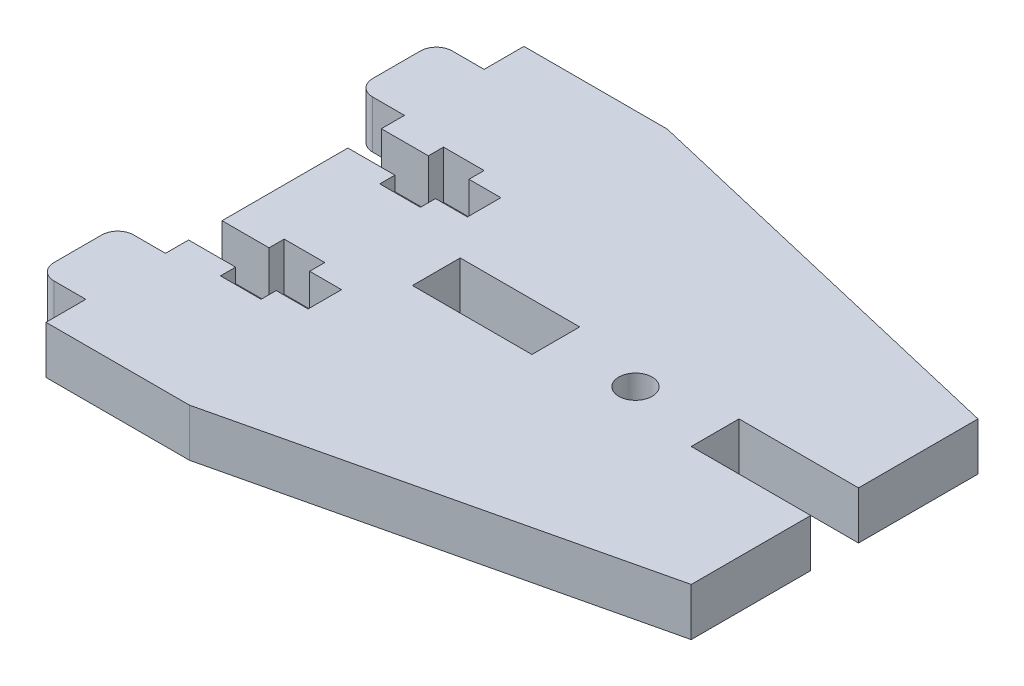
ISO-10303-21;
HEADER;
FILE_DESCRIPTION(('STEP AP214'),'2;1');
FILE_NAME('part.step','',(''),(''),'','','');
FILE_SCHEMA(('AUTOMOTIVE_DESIGN { 1 0 10303 214 1 1 1 1 }'));
ENDSEC;
DATA;
#1=APPLICATION_CONTEXT('core data for automotive mechanical design processes');
#2=APPLICATION_PROTOCOL_DEFINITION('international standard','automotive_design',2000,#1);
#3=PRODUCT_CONTEXT('',#1,'mechanical');
#4=PRODUCT('Part','Part','',(#3));
#5=PRODUCT_RELATED_PRODUCT_CATEGORY('part','',(#4));
#6=PRODUCT_DEFINITION_FORMATION('','',#4);
#7=PRODUCT_DEFINITION_CONTEXT('part definition',#1,'design');
#8=PRODUCT_DEFINITION('design','',#6,#7);
#9=PRODUCT_DEFINITION_SHAPE('','',#8);
#10=(LENGTH_UNIT() NAMED_UNIT(*) SI_UNIT(.MILLI.,.METRE.));
#11=(NAMED_UNIT(*) PLANE_ANGLE_UNIT() SI_UNIT($,.RADIAN.));
#12=(NAMED_UNIT(*) SI_UNIT($,.STERADIAN.) SOLID_ANGLE_UNIT());
#13=UNCERTAINTY_MEASURE_WITH_UNIT(LENGTH_MEASURE(1.E-05),#10,'distance_accuracy_value','');
#14=(GEOMETRIC_REPRESENTATION_CONTEXT(3) GLOBAL_UNCERTAINTY_ASSIGNED_CONTEXT((#13)) GLOBAL_UNIT_ASSIGNED_CONTEXT((#10,
#11,#12)) REPRESENTATION_CONTEXT('',''));
#15=CARTESIAN_POINT('',(0.,0.,0.));
#16=DIRECTION('',(0.,0.,1.));
#17=DIRECTION('',(1.,0.,0.));
#18=AXIS2_PLACEMENT_3D('',#15,#16,#17);
#19=CARTESIAN_POINT('',(19.,6.,0.));
#20=DIRECTION('',(1.,0.,0.));
#21=DIRECTION('',(0.,0.,-1.));
#22=AXIS2_PLACEMENT_3D('',#19,#20,#21);
#23=PLANE('',#22);
#24=DIRECTION('',(0.,0.,1.));
#25=VECTOR('',#24,1.);
#26=CARTESIAN_POINT('',(19.,0.,0.));
#27=LINE('',#26,#25);
#28=CARTESIAN_POINT('',(19.,0.,-33.));
#29=VERTEX_POINT('',#28);
#30=CARTESIAN_POINT('',(19.,0.,-27.));
#31=VERTEX_POINT('',#30);
#32=EDGE_CURVE('E496',#29,#31,#27,.T.);
#33=ORIENTED_EDGE('',*,*,#32,.F.);
#34=DIRECTION('',(0.,-1.,0.));
#35=VECTOR('',#34,1.);
#36=CARTESIAN_POINT('',(19.,6.,-33.));
#37=LINE('',#36,#35);
#38=CARTESIAN_POINT('',(19.,6.,-33.));
#39=VERTEX_POINT('',#38);
#40=EDGE_CURVE('E11',#39,#29,#37,.T.);
#41=ORIENTED_EDGE('',*,*,#40,.F.);
#42=DIRECTION('',(0.,0.,1.));
#43=VECTOR('',#42,1.);
#44=CARTESIAN_POINT('',(19.,6.,0.));
#45=LINE('',#44,#43);
#46=CARTESIAN_POINT('',(19.,6.,-27.));
#47=VERTEX_POINT('',#46);
#48=EDGE_CURVE('E382',#39,#47,#45,.T.);
#49=ORIENTED_EDGE('',*,*,#48,.T.);
#50=DIRECTION('',(0.,-1.,0.));
#51=VECTOR('',#50,1.);
#52=CARTESIAN_POINT('',(19.,6.,-27.));
#53=LINE('',#52,#51);
#54=EDGE_CURVE('E217',#47,#31,#53,.T.);
#55=ORIENTED_EDGE('',*,*,#54,.T.);
#56=EDGE_LOOP('',(#33,#41,#49,#55));
#57=FACE_BOUND('',#56,.T.);
#58=ADVANCED_FACE('F37',(#57),#23,.T.);
#59=CARTESIAN_POINT('',(0.,6.,-33.));
#60=DIRECTION('',(0.,0.,1.));
#61=DIRECTION('',(1.,0.,0.));
#62=AXIS2_PLACEMENT_3D('',#59,#60,#61);
#63=PLANE('',#62);
#64=DIRECTION('',(-1.,0.,0.));
#65=VECTOR('',#64,1.);
#66=CARTESIAN_POINT('',(0.,0.,-33.));
#67=LINE('',#66,#65);
#68=CARTESIAN_POINT('',(34.,0.,-33.));
#69=VERTEX_POINT('',#68);
#70=EDGE_CURVE('E372',#69,#29,#67,.T.);
#71=ORIENTED_EDGE('',*,*,#70,.F.);
#72=DIRECTION('',(0.,-1.,0.));
#73=VECTOR('',#72,1.);
#74=CARTESIAN_POINT('',(34.,6.,-33.));
#75=LINE('',#74,#73);
#76=CARTESIAN_POINT('',(34.,6.,-33.));
#77=VERTEX_POINT('',#76);
#78=EDGE_CURVE('E47',#77,#69,#75,.T.);
#79=ORIENTED_EDGE('',*,*,#78,.F.);
#80=DIRECTION('',(-1.,0.,0.));
#81=VECTOR('',#80,1.);
#82=CARTESIAN_POINT('',(0.,6.,-33.));
#83=LINE('',#82,#81);
#84=EDGE_CURVE('E370',#77,#39,#83,.T.);
#85=ORIENTED_EDGE('',*,*,#84,.T.);
#86=ORIENTED_EDGE('',*,*,#40,.T.);
#87=EDGE_LOOP('',(#71,#79,#85,#86));
#88=FACE_BOUND('',#87,.T.);
#89=ADVANCED_FACE('F368',(#88),#63,.T.);
#90=CARTESIAN_POINT('',(34.,6.,0.));
#91=DIRECTION('',(1.,0.,0.));
#92=DIRECTION('',(0.,0.,-1.));
#93=AXIS2_PLACEMENT_3D('',#90,#91,#92);
#94=PLANE('',#93);
#95=DIRECTION('',(0.,0.,1.));
#96=VECTOR('',#95,1.);
#97=CARTESIAN_POINT('',(34.,0.,0.));
#98=LINE('',#97,#96);
#99=CARTESIAN_POINT('',(34.,0.,-27.));
#100=VERTEX_POINT('',#99);
#101=EDGE_CURVE('E499',#69,#100,#98,.T.);
#102=ORIENTED_EDGE('',*,*,#101,.T.);
#103=DIRECTION('',(0.,-1.,0.));
#104=VECTOR('',#103,1.);
#105=CARTESIAN_POINT('',(34.,6.,-27.));
#106=LINE('',#105,#104);
#107=CARTESIAN_POINT('',(34.,6.,-27.));
#108=VERTEX_POINT('',#107);
#109=EDGE_CURVE('E375',#108,#100,#106,.T.);
#110=ORIENTED_EDGE('',*,*,#109,.F.);
#111=DIRECTION('',(0.,0.,1.));
#112=VECTOR('',#111,1.);
#113=CARTESIAN_POINT('',(34.,6.,0.));
#114=LINE('',#113,#112);
#115=EDGE_CURVE('E378',#77,#108,#114,.T.);
#116=ORIENTED_EDGE('',*,*,#115,.F.);
#117=ORIENTED_EDGE('',*,*,#78,.T.);
#118=EDGE_LOOP('',(#102,#110,#116,#117));
#119=FACE_BOUND('',#118,.T.);
#120=ADVANCED_FACE('F379',(#119),#94,.F.);
#121=CARTESIAN_POINT('',(0.,6.,-15.));
#122=DIRECTION('',(0.,0.,1.));
#123=DIRECTION('',(1.,0.,0.));
#124=AXIS2_PLACEMENT_3D('',#121,#122,#123);
#125=PLANE('',#124);
#126=DIRECTION('',(-1.,0.,0.));
#127=VECTOR('',#126,1.);
#128=CARTESIAN_POINT('',(0.,0.,-15.));
#129=LINE('',#128,#127);
#130=CARTESIAN_POINT('',(0.,0.,-15.));
#131=VERTEX_POINT('',#130);
#132=CARTESIAN_POINT('',(-3.99999999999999,0.,-15.));
#133=VERTEX_POINT('',#132);
#134=EDGE_CURVE('E390',#131,#133,#129,.T.);
#135=ORIENTED_EDGE('',*,*,#134,.T.);
#136=DIRECTION('',(0.,-1.,0.));
#137=VECTOR('',#136,1.);
#138=CARTESIAN_POINT('',(-3.99999999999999,6.,-15.));
#139=LINE('',#138,#137);
#140=CARTESIAN_POINT('',(-3.99999999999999,6.,-15.));
#141=VERTEX_POINT('',#140);
#142=EDGE_CURVE('E41',#141,#133,#139,.T.);
#143=ORIENTED_EDGE('',*,*,#142,.F.);
#144=DIRECTION('',(-1.,0.,0.));
#145=VECTOR('',#144,1.);
#146=CARTESIAN_POINT('',(0.,6.,-15.));
#147=LINE('',#146,#145);
#148=CARTESIAN_POINT('',(0.,6.,-15.));
#149=VERTEX_POINT('',#148);
#150=EDGE_CURVE('E502',#149,#141,#147,.T.);
#151=ORIENTED_EDGE('',*,*,#150,.F.);
#152=DIRECTION('',(0.,-1.,0.));
#153=VECTOR('',#152,1.);
#154=CARTESIAN_POINT('',(0.,6.,-15.));
#155=LINE('',#154,#153);
#156=EDGE_CURVE('E389',#149,#131,#155,.T.);
#157=ORIENTED_EDGE('',*,*,#156,.T.);
#158=EDGE_LOOP('',(#135,#143,#151,#157));
#159=FACE_BOUND('',#158,.T.);
#160=ADVANCED_FACE('F39',(#159),#125,.F.);
#161=CARTESIAN_POINT('',(-4.,6.,-13.));
#162=DIRECTION('',(0.,-1.,0.));
#163=DIRECTION('',(0.,0.,-1.));
#164=AXIS2_PLACEMENT_3D('',#161,#162,#163);
#165=CYLINDRICAL_SURFACE('',#164,2.);
#166=CARTESIAN_POINT('',(-4.,0.,-13.));
#167=DIRECTION('',(0.,1.,0.));
#168=DIRECTION('',(0.,0.,1.));
#169=AXIS2_PLACEMENT_3D('',#166,#167,#168);
#170=CIRCLE('',#169,2.);
#171=CARTESIAN_POINT('',(-6.,0.,-13.));
#172=VERTEX_POINT('',#171);
#173=EDGE_CURVE('E393',#133,#172,#170,.T.);
#174=ORIENTED_EDGE('',*,*,#173,.T.);
#175=DIRECTION('',(0.,-1.,0.));
#176=VECTOR('',#175,1.);
#177=CARTESIAN_POINT('',(-6.,6.,-13.));
#178=LINE('',#177,#176);
#179=CARTESIAN_POINT('',(-6.,6.,-13.));
#180=VERTEX_POINT('',#179);
#181=EDGE_CURVE('E602',#180,#172,#178,.T.);
#182=ORIENTED_EDGE('',*,*,#181,.F.);
#183=CARTESIAN_POINT('',(-4.,6.,-13.));
#184=DIRECTION('',(0.,1.,0.));
#185=DIRECTION('',(0.,0.,1.));
#186=AXIS2_PLACEMENT_3D('',#183,#184,#185);
#187=CIRCLE('',#186,2.);
#188=EDGE_CURVE('E225',#141,#180,#187,.T.);
#189=ORIENTED_EDGE('',*,*,#188,.F.);
#190=ORIENTED_EDGE('',*,*,#142,.T.);
#191=EDGE_LOOP('',(#174,#182,#189,#190));
#192=FACE_BOUND('',#191,.T.);
#193=ADVANCED_FACE('F608',(#192),#165,.T.);
#194=CARTESIAN_POINT('',(-6.,6.,0.));
#195=DIRECTION('',(1.,0.,0.));
#196=DIRECTION('',(0.,0.,-1.));
#197=AXIS2_PLACEMENT_3D('',#194,#195,#196);
#198=PLANE('',#197);
#199=DIRECTION('',(0.,0.,1.));
#200=VECTOR('',#199,1.);
#201=CARTESIAN_POINT('',(-6.,0.,0.));
#202=LINE('',#201,#200);
#203=CARTESIAN_POINT('',(-6.,0.,-7.00000000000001));
#204=VERTEX_POINT('',#203);
#205=EDGE_CURVE('E395',#172,#204,#202,.T.);
#206=ORIENTED_EDGE('',*,*,#205,.T.);
#207=DIRECTION('',(0.,-1.,0.));
#208=VECTOR('',#207,1.);
#209=CARTESIAN_POINT('',(-6.,6.,-7.00000000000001));
#210=LINE('',#209,#208);
#211=CARTESIAN_POINT('',(-6.,6.,-7.00000000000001));
#212=VERTEX_POINT('',#211);
#213=EDGE_CURVE('E601',#212,#204,#210,.T.);
#214=ORIENTED_EDGE('',*,*,#213,.F.);
#215=DIRECTION('',(0.,0.,1.));
#216=VECTOR('',#215,1.);
#217=CARTESIAN_POINT('',(-6.,6.,0.));
#218=LINE('',#217,#216);
#219=EDGE_CURVE('E984',#180,#212,#218,.T.);
#220=ORIENTED_EDGE('',*,*,#219,.F.);
#221=ORIENTED_EDGE('',*,*,#181,.T.);
#222=EDGE_LOOP('',(#206,#214,#220,#221));
#223=FACE_BOUND('',#222,.T.);
#224=ADVANCED_FACE('F706',(#223),#198,.F.);
#225=CARTESIAN_POINT('',(-4.,6.,-7.));
#226=DIRECTION('',(0.,-1.,0.));
#227=DIRECTION('',(0.,0.,-1.));
#228=AXIS2_PLACEMENT_3D('',#225,#226,#227);
#229=CYLINDRICAL_SURFACE('',#228,2.);
#230=CARTESIAN_POINT('',(-4.,0.,-7.));
#231=DIRECTION('',(0.,1.,0.));
#232=DIRECTION('',(0.,0.,1.));
#233=AXIS2_PLACEMENT_3D('',#230,#231,#232);
#234=CIRCLE('',#233,2.);
#235=CARTESIAN_POINT('',(-3.99999999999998,0.,-5.));
#236=VERTEX_POINT('',#235);
#237=EDGE_CURVE('E398',#236,#204,#234,.F.);
#238=ORIENTED_EDGE('',*,*,#237,.F.);
#239=DIRECTION('',(0.,-1.,0.));
#240=VECTOR('',#239,1.);
#241=CARTESIAN_POINT('',(-3.99999999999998,6.,-5.));
#242=LINE('',#241,#240);
#243=CARTESIAN_POINT('',(-3.99999999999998,6.,-5.));
#244=VERTEX_POINT('',#243);
#245=EDGE_CURVE('E599',#244,#236,#242,.T.);
#246=ORIENTED_EDGE('',*,*,#245,.F.);
#247=CARTESIAN_POINT('',(-4.,6.,-7.));
#248=DIRECTION('',(0.,1.,0.));
#249=DIRECTION('',(0.,0.,1.));
#250=AXIS2_PLACEMENT_3D('',#247,#248,#249);
#251=CIRCLE('',#250,2.);
#252=EDGE_CURVE('E705',#244,#212,#251,.F.);
#253=ORIENTED_EDGE('',*,*,#252,.T.);
#254=ORIENTED_EDGE('',*,*,#213,.T.);
#255=EDGE_LOOP('',(#238,#246,#253,#254));
#256=FACE_BOUND('',#255,.T.);
#257=ADVANCED_FACE('F701',(#256),#229,.T.);
#258=CARTESIAN_POINT('',(0.,6.,-5.));
#259=DIRECTION('',(0.,0.,1.));
#260=DIRECTION('',(1.,0.,0.));
#261=AXIS2_PLACEMENT_3D('',#258,#259,#260);
#262=PLANE('',#261);
#263=DIRECTION('',(-1.,0.,0.));
#264=VECTOR('',#263,1.);
#265=CARTESIAN_POINT('',(0.,0.,-5.));
#266=LINE('',#265,#264);
#267=CARTESIAN_POINT('',(0.,0.,-5.));
#268=VERTEX_POINT('',#267);
#269=EDGE_CURVE('E401',#268,#236,#266,.T.);
#270=ORIENTED_EDGE('',*,*,#269,.F.);
#271=DIRECTION('',(0.,-1.,0.));
#272=VECTOR('',#271,1.);
#273=CARTESIAN_POINT('',(0.,6.,-5.));
#274=LINE('',#273,#272);
#275=CARTESIAN_POINT('',(0.,6.,-5.));
#276=VERTEX_POINT('',#275);
#277=EDGE_CURVE('E597',#276,#268,#274,.T.);
#278=ORIENTED_EDGE('',*,*,#277,.F.);
#279=DIRECTION('',(-1.,0.,0.));
#280=VECTOR('',#279,1.);
#281=CARTESIAN_POINT('',(0.,6.,-5.));
#282=LINE('',#281,#280);
#283=EDGE_CURVE('E931',#276,#244,#282,.T.);
#284=ORIENTED_EDGE('',*,*,#283,.T.);
#285=ORIENTED_EDGE('',*,*,#245,.T.);
#286=EDGE_LOOP('',(#270,#278,#284,#285));
#287=FACE_BOUND('',#286,.T.);
#288=ADVANCED_FACE('F698',(#287),#262,.T.);
#289=CARTESIAN_POINT('',(0.,6.,0.));
#290=DIRECTION('',(-1.,0.,0.));
#291=DIRECTION('',(0.,0.,1.));
#292=AXIS2_PLACEMENT_3D('',#289,#290,#291);
#293=PLANE('',#292);
#294=DIRECTION('',(0.,0.,-1.));
#295=VECTOR('',#294,1.);
#296=CARTESIAN_POINT('',(0.,0.,0.));
#297=LINE('',#296,#295);
#298=CARTESIAN_POINT('',(0.,0.,0.));
#299=VERTEX_POINT('',#298);
#300=EDGE_CURVE('E404',#299,#268,#297,.T.);
#301=ORIENTED_EDGE('',*,*,#300,.F.);
#302=DIRECTION('',(0.,-1.,0.));
#303=VECTOR('',#302,1.);
#304=CARTESIAN_POINT('',(0.,6.,0.));
#305=LINE('',#304,#303);
#306=CARTESIAN_POINT('',(0.,6.,0.));
#307=VERTEX_POINT('',#306);
#308=EDGE_CURVE('E595',#307,#299,#305,.T.);
#309=ORIENTED_EDGE('',*,*,#308,.F.);
#310=DIRECTION('',(0.,0.,-1.));
#311=VECTOR('',#310,1.);
#312=CARTESIAN_POINT('',(0.,6.,0.));
#313=LINE('',#312,#311);
#314=EDGE_CURVE('E694',#307,#276,#313,.T.);
#315=ORIENTED_EDGE('',*,*,#314,.T.);
#316=ORIENTED_EDGE('',*,*,#277,.T.);
#317=EDGE_LOOP('',(#301,#309,#315,#316));
#318=FACE_BOUND('',#317,.T.);
#319=ADVANCED_FACE('F689',(#318),#293,.T.);
#320=CARTESIAN_POINT('',(0.,6.,0.));
#321=DIRECTION('',(0.,0.,-1.));
#322=DIRECTION('',(-1.,0.,0.));
#323=AXIS2_PLACEMENT_3D('',#320,#321,#322);
#324=PLANE('',#323);
#325=DIRECTION('',(1.,0.,0.));
#326=VECTOR('',#325,1.);
#327=CARTESIAN_POINT('',(0.,0.,0.));
#328=LINE('',#327,#326);
#329=CARTESIAN_POINT('',(18.,0.,0.));
#330=VERTEX_POINT('',#329);
#331=EDGE_CURVE('E407',#299,#330,#328,.T.);
#332=ORIENTED_EDGE('',*,*,#331,.T.);
#333=DIRECTION('',(0.,-1.,0.));
#334=VECTOR('',#333,1.);
#335=CARTESIAN_POINT('',(18.,6.,0.));
#336=LINE('',#335,#334);
#337=CARTESIAN_POINT('',(18.,6.,0.));
#338=VERTEX_POINT('',#337);
#339=EDGE_CURVE('E592',#338,#330,#336,.T.);
#340=ORIENTED_EDGE('',*,*,#339,.F.);
#341=DIRECTION('',(1.,0.,0.));
#342=VECTOR('',#341,1.);
#343=CARTESIAN_POINT('',(0.,6.,0.));
#344=LINE('',#343,#342);
#345=EDGE_CURVE('E930',#307,#338,#344,.T.);
#346=ORIENTED_EDGE('',*,*,#345,.F.);
#347=ORIENTED_EDGE('',*,*,#308,.T.);
#348=EDGE_LOOP('',(#332,#340,#346,#347));
#349=FACE_BOUND('',#348,.T.);
#350=ADVANCED_FACE('F830',(#349),#324,.F.);
#351=CARTESIAN_POINT('',(0.944262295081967,6.,4.01311475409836));
#352=DIRECTION('',(-0.229039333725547,0.,-0.973417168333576));
#353=DIRECTION('',(-0.973417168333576,0.,0.229039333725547));
#354=AXIS2_PLACEMENT_3D('',#351,#352,#353);
#355=PLANE('',#354);
#356=DIRECTION('',(0.973417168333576,0.,-0.229039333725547));
#357=VECTOR('',#356,1.);
#358=CARTESIAN_POINT('',(0.944262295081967,0.,4.01311475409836));
#359=LINE('',#358,#357);
#360=CARTESIAN_POINT('',(69.,0.,-12.));
#361=VERTEX_POINT('',#360);
#362=EDGE_CURVE('E411',#330,#361,#359,.T.);
#363=ORIENTED_EDGE('',*,*,#362,.T.);
#364=DIRECTION('',(0.,-1.,0.));
#365=VECTOR('',#364,1.);
#366=CARTESIAN_POINT('',(69.,6.,-12.));
#367=LINE('',#366,#365);
#368=CARTESIAN_POINT('',(69.,6.,-12.));
#369=VERTEX_POINT('',#368);
#370=EDGE_CURVE('E589',#369,#361,#367,.T.);
#371=ORIENTED_EDGE('',*,*,#370,.F.);
#372=DIRECTION('',(0.973417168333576,0.,-0.229039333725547));
#373=VECTOR('',#372,1.);
#374=CARTESIAN_POINT('',(0.944262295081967,6.,4.01311475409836));
#375=LINE('',#374,#373);
#376=EDGE_CURVE('E683',#338,#369,#375,.T.);
#377=ORIENTED_EDGE('',*,*,#376,.F.);
#378=ORIENTED_EDGE('',*,*,#339,.T.);
#379=EDGE_LOOP('',(#363,#371,#377,#378));
#380=FACE_BOUND('',#379,.T.);
#381=ADVANCED_FACE('F682',(#380),#355,.F.);
#382=CARTESIAN_POINT('',(69.,6.,0.));
#383=DIRECTION('',(-1.,0.,0.));
#384=DIRECTION('',(0.,0.,1.));
#385=AXIS2_PLACEMENT_3D('',#382,#383,#384);
#386=PLANE('',#385);
#387=DIRECTION('',(0.,0.,-1.));
#388=VECTOR('',#387,1.);
#389=CARTESIAN_POINT('',(69.,0.,0.));
#390=LINE('',#389,#388);
#391=CARTESIAN_POINT('',(69.,0.,-27.));
#392=VERTEX_POINT('',#391);
#393=EDGE_CURVE('E413',#361,#392,#390,.T.);
#394=ORIENTED_EDGE('',*,*,#393,.T.);
#395=DIRECTION('',(0.,-1.,0.));
#396=VECTOR('',#395,1.);
#397=CARTESIAN_POINT('',(69.,6.,-27.));
#398=LINE('',#397,#396);
#399=CARTESIAN_POINT('',(69.,6.,-27.));
#400=VERTEX_POINT('',#399);
#401=EDGE_CURVE('E586',#400,#392,#398,.T.);
#402=ORIENTED_EDGE('',*,*,#401,.F.);
#403=DIRECTION('',(0.,0.,-1.));
#404=VECTOR('',#403,1.);
#405=CARTESIAN_POINT('',(69.,6.,0.));
#406=LINE('',#405,#404);
#407=EDGE_CURVE('E678',#369,#400,#406,.T.);
#408=ORIENTED_EDGE('',*,*,#407,.F.);
#409=ORIENTED_EDGE('',*,*,#370,.T.);
#410=EDGE_LOOP('',(#394,#402,#408,#409));
#411=FACE_BOUND('',#410,.T.);
#412=ADVANCED_FACE('F677',(#411),#386,.F.);
#413=CARTESIAN_POINT('',(0.,6.,-27.));
#414=DIRECTION('',(0.,0.,1.));
#415=DIRECTION('',(1.,0.,0.));
#416=AXIS2_PLACEMENT_3D('',#413,#414,#415);
#417=PLANE('',#416);
#418=DIRECTION('',(-1.,0.,0.));
#419=VECTOR('',#418,1.);
#420=CARTESIAN_POINT('',(0.,0.,-27.));
#421=LINE('',#420,#419);
#422=CARTESIAN_POINT('',(54.,0.,-27.));
#423=VERTEX_POINT('',#422);
#424=EDGE_CURVE('E415',#392,#423,#421,.T.);
#425=ORIENTED_EDGE('',*,*,#424,.T.);
#426=DIRECTION('',(0.,-1.,0.));
#427=VECTOR('',#426,1.);
#428=CARTESIAN_POINT('',(54.,6.,-27.));
#429=LINE('',#428,#427);
#430=CARTESIAN_POINT('',(54.,6.,-27.));
#431=VERTEX_POINT('',#430);
#432=EDGE_CURVE('E584',#431,#423,#429,.T.);
#433=ORIENTED_EDGE('',*,*,#432,.F.);
#434=DIRECTION('',(-1.,0.,0.));
#435=VECTOR('',#434,1.);
#436=CARTESIAN_POINT('',(0.,6.,-27.));
#437=LINE('',#436,#435);
#438=EDGE_CURVE('E674',#400,#431,#437,.T.);
#439=ORIENTED_EDGE('',*,*,#438,.F.);
#440=ORIENTED_EDGE('',*,*,#401,.T.);
#441=EDGE_LOOP('',(#425,#433,#439,#440));
#442=FACE_BOUND('',#441,.T.);
#443=ADVANCED_FACE('F671',(#442),#417,.F.);
#444=CARTESIAN_POINT('',(54.,6.,0.));
#445=DIRECTION('',(1.,0.,0.));
#446=DIRECTION('',(0.,0.,-1.));
#447=AXIS2_PLACEMENT_3D('',#444,#445,#446);
#448=PLANE('',#447);
#449=DIRECTION('',(0.,0.,1.));
#450=VECTOR('',#449,1.);
#451=CARTESIAN_POINT('',(54.,0.,0.));
#452=LINE('',#451,#450);
#453=CARTESIAN_POINT('',(54.,0.,-33.));
#454=VERTEX_POINT('',#453);
#455=EDGE_CURVE('E419',#454,#423,#452,.T.);
#456=ORIENTED_EDGE('',*,*,#455,.F.);
#457=DIRECTION('',(0.,-1.,0.));
#458=VECTOR('',#457,1.);
#459=CARTESIAN_POINT('',(54.,6.,-33.));
#460=LINE('',#459,#458);
#461=CARTESIAN_POINT('',(54.,6.,-33.));
#462=VERTEX_POINT('',#461);
#463=EDGE_CURVE('E582',#462,#454,#460,.T.);
#464=ORIENTED_EDGE('',*,*,#463,.F.);
#465=DIRECTION('',(0.,0.,1.));
#466=VECTOR('',#465,1.);
#467=CARTESIAN_POINT('',(54.,6.,0.));
#468=LINE('',#467,#466);
#469=EDGE_CURVE('E980',#462,#431,#468,.T.);
#470=ORIENTED_EDGE('',*,*,#469,.T.);
#471=ORIENTED_EDGE('',*,*,#432,.T.);
#472=EDGE_LOOP('',(#456,#464,#470,#471));
#473=FACE_BOUND('',#472,.T.);
#474=ADVANCED_FACE('F665',(#473),#448,.T.);
#475=CARTESIAN_POINT('',(0.,6.,-33.));
#476=DIRECTION('',(0.,0.,1.));
#477=DIRECTION('',(1.,0.,0.));
#478=AXIS2_PLACEMENT_3D('',#475,#476,#477);
#479=PLANE('',#478);
#480=DIRECTION('',(-1.,0.,0.));
#481=VECTOR('',#480,1.);
#482=CARTESIAN_POINT('',(0.,0.,-33.));
#483=LINE('',#482,#481);
#484=CARTESIAN_POINT('',(69.,0.,-33.));
#485=VERTEX_POINT('',#484);
#486=EDGE_CURVE('E422',#485,#454,#483,.T.);
#487=ORIENTED_EDGE('',*,*,#486,.F.);
#488=DIRECTION('',(0.,-1.,0.));
#489=VECTOR('',#488,1.);
#490=CARTESIAN_POINT('',(69.,6.,-33.));
#491=LINE('',#490,#489);
#492=CARTESIAN_POINT('',(69.,6.,-33.));
#493=VERTEX_POINT('',#492);
#494=EDGE_CURVE('E580',#493,#485,#491,.T.);
#495=ORIENTED_EDGE('',*,*,#494,.F.);
#496=DIRECTION('',(-1.,0.,0.));
#497=VECTOR('',#496,1.);
#498=CARTESIAN_POINT('',(0.,6.,-33.));
#499=LINE('',#498,#497);
#500=EDGE_CURVE('E661',#493,#462,#499,.T.);
#501=ORIENTED_EDGE('',*,*,#500,.T.);
#502=ORIENTED_EDGE('',*,*,#463,.T.);
#503=EDGE_LOOP('',(#487,#495,#501,#502));
#504=FACE_BOUND('',#503,.T.);
#505=ADVANCED_FACE('F656',(#504),#479,.T.);
#506=CARTESIAN_POINT('',(69.,0.,-48.));
#507=VERTEX_POINT('',#506);
#508=EDGE_CURVE('E416',#485,#507,#390,.T.);
#509=ORIENTED_EDGE('',*,*,#508,.T.);
#510=DIRECTION('',(0.,-1.,0.));
#511=VECTOR('',#510,1.);
#512=CARTESIAN_POINT('',(69.,6.,-48.));
#513=LINE('',#512,#511);
#514=CARTESIAN_POINT('',(69.,6.,-48.));
#515=VERTEX_POINT('',#514);
#516=EDGE_CURVE('E578',#515,#507,#513,.T.);
#517=ORIENTED_EDGE('',*,*,#516,.F.);
#518=EDGE_CURVE('E978',#493,#515,#406,.T.);
#519=ORIENTED_EDGE('',*,*,#518,.F.);
#520=ORIENTED_EDGE('',*,*,#494,.T.);
#521=EDGE_LOOP('',(#509,#517,#519,#520));
#522=FACE_BOUND('',#521,.T.);
#523=ADVANCED_FACE('F819',(#522),#386,.F.);
#524=CARTESIAN_POINT('',(14.3213114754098,6.,-60.8655737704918));
#525=DIRECTION('',(0.229039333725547,0.,-0.973417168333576));
#526=DIRECTION('',(-0.973417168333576,0.,-0.229039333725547));
#527=AXIS2_PLACEMENT_3D('',#524,#525,#526);
#528=PLANE('',#527);
#529=DIRECTION('',(0.973417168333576,0.,0.229039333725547));
#530=VECTOR('',#529,1.);
#531=CARTESIAN_POINT('',(14.3213114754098,0.,-60.8655737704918));
#532=LINE('',#531,#530);
#533=CARTESIAN_POINT('',(18.,0.,-60.));
#534=VERTEX_POINT('',#533);
#535=EDGE_CURVE('E425',#534,#507,#532,.T.);
#536=ORIENTED_EDGE('',*,*,#535,.F.);
#537=DIRECTION('',(0.,-1.,0.));
#538=VECTOR('',#537,1.);
#539=CARTESIAN_POINT('',(18.,6.,-60.));
#540=LINE('',#539,#538);
#541=CARTESIAN_POINT('',(18.,6.,-60.));
#542=VERTEX_POINT('',#541);
#543=EDGE_CURVE('E576',#542,#534,#540,.T.);
#544=ORIENTED_EDGE('',*,*,#543,.F.);
#545=DIRECTION('',(0.973417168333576,0.,0.229039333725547));
#546=VECTOR('',#545,1.);
#547=CARTESIAN_POINT('',(14.3213114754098,6.,-60.8655737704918));
#548=LINE('',#547,#546);
#549=EDGE_CURVE('E926',#542,#515,#548,.T.);
#550=ORIENTED_EDGE('',*,*,#549,.T.);
#551=ORIENTED_EDGE('',*,*,#516,.T.);
#552=EDGE_LOOP('',(#536,#544,#550,#551));
#553=FACE_BOUND('',#552,.T.);
#554=ADVANCED_FACE('F649',(#553),#528,.T.);
#555=CARTESIAN_POINT('',(0.,6.,-60.));
#556=DIRECTION('',(0.,0.,-1.));
#557=DIRECTION('',(-1.,0.,0.));
#558=AXIS2_PLACEMENT_3D('',#555,#556,#557);
#559=PLANE('',#558);
#560=DIRECTION('',(1.,0.,0.));
#561=VECTOR('',#560,1.);
#562=CARTESIAN_POINT('',(0.,0.,-60.));
#563=LINE('',#562,#561);
#564=CARTESIAN_POINT('',(0.,0.,-60.));
#565=VERTEX_POINT('',#564);
#566=EDGE_CURVE('E428',#565,#534,#563,.T.);
#567=ORIENTED_EDGE('',*,*,#566,.F.);
#568=DIRECTION('',(0.,-1.,0.));
#569=VECTOR('',#568,1.);
#570=CARTESIAN_POINT('',(0.,6.,-60.));
#571=LINE('',#570,#569);
#572=CARTESIAN_POINT('',(0.,6.,-60.));
#573=VERTEX_POINT('',#572);
#574=EDGE_CURVE('E574',#573,#565,#571,.T.);
#575=ORIENTED_EDGE('',*,*,#574,.F.);
#576=DIRECTION('',(1.,0.,0.));
#577=VECTOR('',#576,1.);
#578=CARTESIAN_POINT('',(0.,6.,-60.));
#579=LINE('',#578,#577);
#580=EDGE_CURVE('E645',#573,#542,#579,.T.);
#581=ORIENTED_EDGE('',*,*,#580,.T.);
#582=ORIENTED_EDGE('',*,*,#543,.T.);
#583=EDGE_LOOP('',(#567,#575,#581,#582));
#584=FACE_BOUND('',#583,.T.);
#585=ADVANCED_FACE('F643',(#584),#559,.T.);
#586=CARTESIAN_POINT('',(0.,0.,-55.));
#587=VERTEX_POINT('',#586);
#588=EDGE_CURVE('E409',#587,#565,#297,.T.);
#589=ORIENTED_EDGE('',*,*,#588,.F.);
#590=DIRECTION('',(0.,-1.,0.));
#591=VECTOR('',#590,1.);
#592=CARTESIAN_POINT('',(0.,6.,-55.));
#593=LINE('',#592,#591);
#594=CARTESIAN_POINT('',(0.,6.,-55.));
#595=VERTEX_POINT('',#594);
#596=EDGE_CURVE('E572',#595,#587,#593,.T.);
#597=ORIENTED_EDGE('',*,*,#596,.F.);
#598=EDGE_CURVE('E639',#595,#573,#313,.T.);
#599=ORIENTED_EDGE('',*,*,#598,.T.);
#600=ORIENTED_EDGE('',*,*,#574,.T.);
#601=EDGE_LOOP('',(#589,#597,#599,#600));
#602=FACE_BOUND('',#601,.T.);
#603=ADVANCED_FACE('F635',(#602),#293,.T.);
#604=CARTESIAN_POINT('',(0.,6.,-55.));
#605=DIRECTION('',(0.,0.,1.));
#606=DIRECTION('',(1.,0.,0.));
#607=AXIS2_PLACEMENT_3D('',#604,#605,#606);
#608=PLANE('',#607);
#609=DIRECTION('',(-1.,0.,0.));
#610=VECTOR('',#609,1.);
#611=CARTESIAN_POINT('',(0.,0.,-55.));
#612=LINE('',#611,#610);
#613=CARTESIAN_POINT('',(-3.99999999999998,0.,-55.));
#614=VERTEX_POINT('',#613);
#615=EDGE_CURVE('E431',#587,#614,#612,.T.);
#616=ORIENTED_EDGE('',*,*,#615,.T.);
#617=DIRECTION('',(0.,-1.,0.));
#618=VECTOR('',#617,1.);
#619=CARTESIAN_POINT('',(-3.99999999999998,6.,-55.));
#620=LINE('',#619,#618);
#621=CARTESIAN_POINT('',(-3.99999999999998,6.,-55.));
#622=VERTEX_POINT('',#621);
#623=EDGE_CURVE('E569',#622,#614,#620,.T.);
#624=ORIENTED_EDGE('',*,*,#623,.F.);
#625=DIRECTION('',(-1.,0.,0.));
#626=VECTOR('',#625,1.);
#627=CARTESIAN_POINT('',(0.,6.,-55.));
#628=LINE('',#627,#626);
#629=EDGE_CURVE('E921',#595,#622,#628,.T.);
#630=ORIENTED_EDGE('',*,*,#629,.F.);
#631=ORIENTED_EDGE('',*,*,#596,.T.);
#632=EDGE_LOOP('',(#616,#624,#630,#631));
#633=FACE_BOUND('',#632,.T.);
#634=ADVANCED_FACE('F810',(#633),#608,.F.);
#635=CARTESIAN_POINT('',(-4.,6.,-53.));
#636=DIRECTION('',(0.,-1.,0.));
#637=DIRECTION('',(0.,0.,-1.));
#638=AXIS2_PLACEMENT_3D('',#635,#636,#637);
#639=CYLINDRICAL_SURFACE('',#638,2.);
#640=CARTESIAN_POINT('',(-4.,0.,-53.));
#641=DIRECTION('',(0.,1.,0.));
#642=DIRECTION('',(0.,0.,1.));
#643=AXIS2_PLACEMENT_3D('',#640,#641,#642);
#644=CIRCLE('',#643,2.);
#645=CARTESIAN_POINT('',(-6.,0.,-53.));
#646=VERTEX_POINT('',#645);
#647=EDGE_CURVE('E433',#614,#646,#644,.T.);
#648=ORIENTED_EDGE('',*,*,#647,.T.);
#649=DIRECTION('',(0.,-1.,0.));
#650=VECTOR('',#649,1.);
#651=CARTESIAN_POINT('',(-6.,6.,-53.));
#652=LINE('',#651,#650);
#653=CARTESIAN_POINT('',(-6.,6.,-53.));
#654=VERTEX_POINT('',#653);
#655=EDGE_CURVE('E566',#654,#646,#652,.T.);
#656=ORIENTED_EDGE('',*,*,#655,.F.);
#657=CARTESIAN_POINT('',(-4.,6.,-53.));
#658=DIRECTION('',(0.,1.,0.));
#659=DIRECTION('',(0.,0.,1.));
#660=AXIS2_PLACEMENT_3D('',#657,#658,#659);
#661=CIRCLE('',#660,2.);
#662=EDGE_CURVE('E919',#622,#654,#661,.T.);
#663=ORIENTED_EDGE('',*,*,#662,.F.);
#664=ORIENTED_EDGE('',*,*,#623,.T.);
#665=EDGE_LOOP('',(#648,#656,#663,#664));
#666=FACE_BOUND('',#665,.T.);
#667=ADVANCED_FACE('F806',(#666),#639,.T.);
#668=CARTESIAN_POINT('',(-5.99999999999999,6.,0.));
#669=DIRECTION('',(1.,0.,0.));
#670=DIRECTION('',(0.,0.,-1.));
#671=AXIS2_PLACEMENT_3D('',#668,#669,#670);
#672=PLANE('',#671);
#673=DIRECTION('',(0.,0.,1.));
#674=VECTOR('',#673,1.);
#675=CARTESIAN_POINT('',(-5.99999999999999,0.,0.));
#676=LINE('',#675,#674);
#677=CARTESIAN_POINT('',(-6.,0.,-47.));
#678=VERTEX_POINT('',#677);
#679=EDGE_CURVE('E435',#646,#678,#676,.T.);
#680=ORIENTED_EDGE('',*,*,#679,.T.);
#681=DIRECTION('',(0.,-1.,0.));
#682=VECTOR('',#681,1.);
#683=CARTESIAN_POINT('',(-6.,6.,-47.));
#684=LINE('',#683,#682);
#685=CARTESIAN_POINT('',(-6.,6.,-47.));
#686=VERTEX_POINT('',#685);
#687=EDGE_CURVE('E564',#686,#678,#684,.T.);
#688=ORIENTED_EDGE('',*,*,#687,.F.);
#689=DIRECTION('',(0.,0.,1.));
#690=VECTOR('',#689,1.);
#691=CARTESIAN_POINT('',(-5.99999999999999,6.,0.));
#692=LINE('',#691,#690);
#693=EDGE_CURVE('E917',#654,#686,#692,.T.);
#694=ORIENTED_EDGE('',*,*,#693,.F.);
#695=ORIENTED_EDGE('',*,*,#655,.T.);
#696=EDGE_LOOP('',(#680,#688,#694,#695));
#697=FACE_BOUND('',#696,.T.);
#698=ADVANCED_FACE('F802',(#697),#672,.F.);
#699=CARTESIAN_POINT('',(-4.,6.,-47.));
#700=DIRECTION('',(0.,-1.,0.));
#701=DIRECTION('',(0.,0.,-1.));
#702=AXIS2_PLACEMENT_3D('',#699,#700,#701);
#703=CYLINDRICAL_SURFACE('',#702,2.);
#704=CARTESIAN_POINT('',(-4.,0.,-47.));
#705=DIRECTION('',(0.,1.,0.));
#706=DIRECTION('',(0.,0.,1.));
#707=AXIS2_PLACEMENT_3D('',#704,#705,#706);
#708=CIRCLE('',#707,2.);
#709=CARTESIAN_POINT('',(-3.99999999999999,0.,-45.));
#710=VERTEX_POINT('',#709);
#711=EDGE_CURVE('E438',#710,#678,#708,.F.);
#712=ORIENTED_EDGE('',*,*,#711,.F.);
#713=DIRECTION('',(0.,-1.,0.));
#714=VECTOR('',#713,1.);
#715=CARTESIAN_POINT('',(-3.99999999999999,6.,-45.));
#716=LINE('',#715,#714);
#717=CARTESIAN_POINT('',(-3.99999999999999,6.,-45.));
#718=VERTEX_POINT('',#717);
#719=EDGE_CURVE('E562',#718,#710,#716,.T.);
#720=ORIENTED_EDGE('',*,*,#719,.F.);
#721=CARTESIAN_POINT('',(-4.,6.,-47.));
#722=DIRECTION('',(0.,1.,0.));
#723=DIRECTION('',(0.,0.,1.));
#724=AXIS2_PLACEMENT_3D('',#721,#722,#723);
#725=CIRCLE('',#724,2.);
#726=EDGE_CURVE('E914',#718,#686,#725,.F.);
#727=ORIENTED_EDGE('',*,*,#726,.T.);
#728=ORIENTED_EDGE('',*,*,#687,.T.);
#729=EDGE_LOOP('',(#712,#720,#727,#728));
#730=FACE_BOUND('',#729,.T.);
#731=ADVANCED_FACE('F798',(#730),#703,.T.);
#732=CARTESIAN_POINT('',(0.,6.,-45.));
#733=DIRECTION('',(0.,0.,1.));
#734=DIRECTION('',(1.,0.,0.));
#735=AXIS2_PLACEMENT_3D('',#732,#733,#734);
#736=PLANE('',#735);
#737=DIRECTION('',(-1.,0.,0.));
#738=VECTOR('',#737,1.);
#739=CARTESIAN_POINT('',(0.,0.,-45.));
#740=LINE('',#739,#738);
#741=CARTESIAN_POINT('',(0.,0.,-45.));
#742=VERTEX_POINT('',#741);
#743=EDGE_CURVE('E441',#742,#710,#740,.T.);
#744=ORIENTED_EDGE('',*,*,#743,.F.);
#745=DIRECTION('',(0.,-1.,0.));
#746=VECTOR('',#745,1.);
#747=CARTESIAN_POINT('',(0.,6.,-45.));
#748=LINE('',#747,#746);
#749=CARTESIAN_POINT('',(0.,6.,-45.));
#750=VERTEX_POINT('',#749);
#751=EDGE_CURVE('E560',#750,#742,#748,.T.);
#752=ORIENTED_EDGE('',*,*,#751,.F.);
#753=DIRECTION('',(-1.,0.,0.));
#754=VECTOR('',#753,1.);
#755=CARTESIAN_POINT('',(0.,6.,-45.));
#756=LINE('',#755,#754);
#757=EDGE_CURVE('E933',#750,#718,#756,.T.);
#758=ORIENTED_EDGE('',*,*,#757,.T.);
#759=ORIENTED_EDGE('',*,*,#719,.T.);
#760=EDGE_LOOP('',(#744,#752,#758,#759));
#761=FACE_BOUND('',#760,.T.);
#762=ADVANCED_FACE('F794',(#761),#736,.T.);
#763=CARTESIAN_POINT('',(0.,0.,-42.1));
#764=VERTEX_POINT('',#763);
#765=EDGE_CURVE('E444',#764,#742,#297,.T.);
#766=ORIENTED_EDGE('',*,*,#765,.F.);
#767=DIRECTION('',(0.,-1.,0.));
#768=VECTOR('',#767,1.);
#769=CARTESIAN_POINT('',(0.,6.,-42.1));
#770=LINE('',#769,#768);
#771=CARTESIAN_POINT('',(0.,6.,-42.1));
#772=VERTEX_POINT('',#771);
#773=EDGE_CURVE('E558',#772,#764,#770,.T.);
#774=ORIENTED_EDGE('',*,*,#773,.F.);
#775=EDGE_CURVE('E905',#772,#750,#313,.T.);
#776=ORIENTED_EDGE('',*,*,#775,.T.);
#777=ORIENTED_EDGE('',*,*,#751,.T.);
#778=EDGE_LOOP('',(#766,#774,#776,#777));
#779=FACE_BOUND('',#778,.T.);
#780=ADVANCED_FACE('F797',(#779),#293,.T.);
#781=CARTESIAN_POINT('',(0.,6.,-42.1));
#782=DIRECTION('',(0.,0.,-1.));
#783=DIRECTION('',(-1.,0.,0.));
#784=AXIS2_PLACEMENT_3D('',#781,#782,#783);
#785=PLANE('',#784);
#786=DIRECTION('',(1.,0.,0.));
#787=VECTOR('',#786,1.);
#788=CARTESIAN_POINT('',(0.,0.,-42.1));
#789=LINE('',#788,#787);
#790=CARTESIAN_POINT('',(5.9,0.,-42.1));
#791=VERTEX_POINT('',#790);
#792=EDGE_CURVE('E445',#764,#791,#789,.T.);
#793=ORIENTED_EDGE('',*,*,#792,.T.);
#794=DIRECTION('',(0.,-1.,0.));
#795=VECTOR('',#794,1.);
#796=CARTESIAN_POINT('',(5.9,6.,-42.1));
#797=LINE('',#796,#795);
#798=CARTESIAN_POINT('',(5.9,6.,-42.1));
#799=VERTEX_POINT('',#798);
#800=EDGE_CURVE('E556',#799,#791,#797,.T.);
#801=ORIENTED_EDGE('',*,*,#800,.F.);
#802=DIRECTION('',(1.,0.,0.));
#803=VECTOR('',#802,1.);
#804=CARTESIAN_POINT('',(0.,6.,-42.1));
#805=LINE('',#804,#803);
#806=EDGE_CURVE('E902',#772,#799,#805,.T.);
#807=ORIENTED_EDGE('',*,*,#806,.F.);
#808=ORIENTED_EDGE('',*,*,#773,.T.);
#809=EDGE_LOOP('',(#793,#801,#807,#808));
#810=FACE_BOUND('',#809,.T.);
#811=ADVANCED_FACE('F789',(#810),#785,.F.);
#812=CARTESIAN_POINT('',(5.9,6.,0.));
#813=DIRECTION('',(1.,0.,0.));
#814=DIRECTION('',(0.,0.,-1.));
#815=AXIS2_PLACEMENT_3D('',#812,#813,#814);
#816=PLANE('',#815);
#817=DIRECTION('',(0.,0.,1.));
#818=VECTOR('',#817,1.);
#819=CARTESIAN_POINT('',(5.9,0.,0.));
#820=LINE('',#819,#818);
#821=CARTESIAN_POINT('',(5.9,0.,-44.));
#822=VERTEX_POINT('',#821);
#823=EDGE_CURVE('E448',#822,#791,#820,.T.);
#824=ORIENTED_EDGE('',*,*,#823,.F.);
#825=DIRECTION('',(0.,-1.,0.));
#826=VECTOR('',#825,1.);
#827=CARTESIAN_POINT('',(5.9,6.,-44.));
#828=LINE('',#827,#826);
#829=CARTESIAN_POINT('',(5.9,6.,-44.));
#830=VERTEX_POINT('',#829);
#831=EDGE_CURVE('E554',#830,#822,#828,.T.);
#832=ORIENTED_EDGE('',*,*,#831,.F.);
#833=DIRECTION('',(0.,0.,1.));
#834=VECTOR('',#833,1.);
#835=CARTESIAN_POINT('',(5.9,6.,0.));
#836=LINE('',#835,#834);
#837=EDGE_CURVE('E900',#830,#799,#836,.T.);
#838=ORIENTED_EDGE('',*,*,#837,.T.);
#839=ORIENTED_EDGE('',*,*,#800,.T.);
#840=EDGE_LOOP('',(#824,#832,#838,#839));
#841=FACE_BOUND('',#840,.T.);
#842=ADVANCED_FACE('F772',(#841),#816,.T.);
#843=CARTESIAN_POINT('',(0.,6.,-44.));
#844=DIRECTION('',(0.,0.,1.));
#845=DIRECTION('',(1.,0.,0.));
#846=AXIS2_PLACEMENT_3D('',#843,#844,#845);
#847=PLANE('',#846);
#848=DIRECTION('',(-1.,0.,0.));
#849=VECTOR('',#848,1.);
#850=CARTESIAN_POINT('',(0.,0.,-44.));
#851=LINE('',#850,#849);
#852=CARTESIAN_POINT('',(11.,0.,-44.));
#853=VERTEX_POINT('',#852);
#854=EDGE_CURVE('E452',#853,#822,#851,.T.);
#855=ORIENTED_EDGE('',*,*,#854,.F.);
#856=DIRECTION('',(0.,-1.,0.));
#857=VECTOR('',#856,1.);
#858=CARTESIAN_POINT('',(11.,6.,-44.));
#859=LINE('',#858,#857);
#860=CARTESIAN_POINT('',(11.,6.,-44.));
#861=VERTEX_POINT('',#860);
#862=EDGE_CURVE('E552',#861,#853,#859,.T.);
#863=ORIENTED_EDGE('',*,*,#862,.F.);
#864=DIRECTION('',(-1.,0.,0.));
#865=VECTOR('',#864,1.);
#866=CARTESIAN_POINT('',(0.,6.,-44.));
#867=LINE('',#866,#865);
#868=EDGE_CURVE('E894',#861,#830,#867,.T.);
#869=ORIENTED_EDGE('',*,*,#868,.T.);
#870=ORIENTED_EDGE('',*,*,#831,.T.);
#871=EDGE_LOOP('',(#855,#863,#869,#870));
#872=FACE_BOUND('',#871,.T.);
#873=ADVANCED_FACE('F790',(#872),#847,.T.);
#874=CARTESIAN_POINT('',(11.,6.,0.));
#875=DIRECTION('',(1.,0.,0.));
#876=DIRECTION('',(0.,0.,-1.));
#877=AXIS2_PLACEMENT_3D('',#874,#875,#876);
#878=PLANE('',#877);
#879=DIRECTION('',(0.,0.,1.));
#880=VECTOR('',#879,1.);
#881=CARTESIAN_POINT('',(11.,0.,0.));
#882=LINE('',#881,#880);
#883=CARTESIAN_POINT('',(11.,0.,-42.1));
#884=VERTEX_POINT('',#883);
#885=EDGE_CURVE('E456',#853,#884,#882,.T.);
#886=ORIENTED_EDGE('',*,*,#885,.T.);
#887=DIRECTION('',(0.,-1.,0.));
#888=VECTOR('',#887,1.);
#889=CARTESIAN_POINT('',(11.,6.,-42.1));
#890=LINE('',#889,#888);
#891=CARTESIAN_POINT('',(11.,6.,-42.1));
#892=VERTEX_POINT('',#891);
#893=EDGE_CURVE('E549',#892,#884,#890,.T.);
#894=ORIENTED_EDGE('',*,*,#893,.F.);
#895=DIRECTION('',(0.,0.,1.));
#896=VECTOR('',#895,1.);
#897=CARTESIAN_POINT('',(11.,6.,0.));
#898=LINE('',#897,#896);
#899=EDGE_CURVE('E891',#861,#892,#898,.T.);
#900=ORIENTED_EDGE('',*,*,#899,.F.);
#901=ORIENTED_EDGE('',*,*,#862,.T.);
#902=EDGE_LOOP('',(#886,#894,#900,#901));
#903=FACE_BOUND('',#902,.T.);
#904=ADVANCED_FACE('F780',(#903),#878,.F.);
#905=CARTESIAN_POINT('',(15.,0.,-42.1));
#906=VERTEX_POINT('',#905);
#907=EDGE_CURVE('E449',#884,#906,#789,.T.);
#908=ORIENTED_EDGE('',*,*,#907,.T.);
#909=DIRECTION('',(0.,-1.,0.));
#910=VECTOR('',#909,1.);
#911=CARTESIAN_POINT('',(15.,6.,-42.1));
#912=LINE('',#911,#910);
#913=CARTESIAN_POINT('',(15.,6.,-42.1));
#914=VERTEX_POINT('',#913);
#915=EDGE_CURVE('E546',#914,#906,#912,.T.);
#916=ORIENTED_EDGE('',*,*,#915,.F.);
#917=EDGE_CURVE('E888',#892,#914,#805,.T.);
#918=ORIENTED_EDGE('',*,*,#917,.F.);
#919=ORIENTED_EDGE('',*,*,#893,.T.);
#920=EDGE_LOOP('',(#908,#916,#918,#919));
#921=FACE_BOUND('',#920,.T.);
#922=ADVANCED_FACE('F784',(#921),#785,.F.);
#923=CARTESIAN_POINT('',(15.,6.,0.));
#924=DIRECTION('',(1.,0.,0.));
#925=DIRECTION('',(0.,0.,-1.));
#926=AXIS2_PLACEMENT_3D('',#923,#924,#925);
#927=PLANE('',#926);
#928=DIRECTION('',(0.,0.,1.));
#929=VECTOR('',#928,1.);
#930=CARTESIAN_POINT('',(15.,0.,0.));
#931=LINE('',#930,#929);
#932=CARTESIAN_POINT('',(15.,0.,-37.9));
#933=VERTEX_POINT('',#932);
#934=EDGE_CURVE('E459',#906,#933,#931,.T.);
#935=ORIENTED_EDGE('',*,*,#934,.T.);
#936=DIRECTION('',(0.,-1.,0.));
#937=VECTOR('',#936,1.);
#938=CARTESIAN_POINT('',(15.,6.,-37.9));
#939=LINE('',#938,#937);
#940=CARTESIAN_POINT('',(15.,6.,-37.9));
#941=VERTEX_POINT('',#940);
#942=EDGE_CURVE('E544',#941,#933,#939,.T.);
#943=ORIENTED_EDGE('',*,*,#942,.F.);
#944=DIRECTION('',(0.,0.,1.));
#945=VECTOR('',#944,1.);
#946=CARTESIAN_POINT('',(15.,6.,0.));
#947=LINE('',#946,#945);
#948=EDGE_CURVE('E969',#914,#941,#947,.T.);
#949=ORIENTED_EDGE('',*,*,#948,.F.);
#950=ORIENTED_EDGE('',*,*,#915,.T.);
#951=EDGE_LOOP('',(#935,#943,#949,#950));
#952=FACE_BOUND('',#951,.T.);
#953=ADVANCED_FACE('F781',(#952),#927,.F.);
#954=CARTESIAN_POINT('',(0.,6.,-37.9));
#955=DIRECTION('',(0.,0.,-1.));
#956=DIRECTION('',(-1.,0.,0.));
#957=AXIS2_PLACEMENT_3D('',#954,#955,#956);
#958=PLANE('',#957);
#959=DIRECTION('',(1.,0.,0.));
#960=VECTOR('',#959,1.);
#961=CARTESIAN_POINT('',(0.,0.,-37.9));
#962=LINE('',#961,#960);
#963=CARTESIAN_POINT('',(11.,0.,-37.9));
#964=VERTEX_POINT('',#963);
#965=EDGE_CURVE('E462',#964,#933,#962,.T.);
#966=ORIENTED_EDGE('',*,*,#965,.F.);
#967=DIRECTION('',(0.,-1.,0.));
#968=VECTOR('',#967,1.);
#969=CARTESIAN_POINT('',(11.,6.,-37.9));
#970=LINE('',#969,#968);
#971=CARTESIAN_POINT('',(11.,6.,-37.9));
#972=VERTEX_POINT('',#971);
#973=EDGE_CURVE('E542',#972,#964,#970,.T.);
#974=ORIENTED_EDGE('',*,*,#973,.F.);
#975=DIRECTION('',(1.,0.,0.));
#976=VECTOR('',#975,1.);
#977=CARTESIAN_POINT('',(0.,6.,-37.9));
#978=LINE('',#977,#976);
#979=EDGE_CURVE('E880',#972,#941,#978,.T.);
#980=ORIENTED_EDGE('',*,*,#979,.T.);
#981=ORIENTED_EDGE('',*,*,#942,.T.);
#982=EDGE_LOOP('',(#966,#974,#980,#981));
#983=FACE_BOUND('',#982,.T.);
#984=ADVANCED_FACE('F767',(#983),#958,.T.);
#985=CARTESIAN_POINT('',(11.,0.,-36.));
#986=VERTEX_POINT('',#985);
#987=EDGE_CURVE('E458',#964,#986,#882,.T.);
#988=ORIENTED_EDGE('',*,*,#987,.T.);
#989=DIRECTION('',(0.,-1.,0.));
#990=VECTOR('',#989,1.);
#991=CARTESIAN_POINT('',(11.,6.,-36.));
#992=LINE('',#991,#990);
#993=CARTESIAN_POINT('',(11.,6.,-36.));
#994=VERTEX_POINT('',#993);
#995=EDGE_CURVE('E539',#994,#986,#992,.T.);
#996=ORIENTED_EDGE('',*,*,#995,.F.);
#997=EDGE_CURVE('E873',#972,#994,#898,.T.);
#998=ORIENTED_EDGE('',*,*,#997,.F.);
#999=ORIENTED_EDGE('',*,*,#973,.T.);
#1000=EDGE_LOOP('',(#988,#996,#998,#999));
#1001=FACE_BOUND('',#1000,.T.);
#1002=ADVANCED_FACE('F775',(#1001),#878,.F.);
#1003=CARTESIAN_POINT('',(0.,6.,-36.));
#1004=DIRECTION('',(0.,0.,1.));
#1005=DIRECTION('',(1.,0.,0.));
#1006=AXIS2_PLACEMENT_3D('',#1003,#1004,#1005);
#1007=PLANE('',#1006);
#1008=DIRECTION('',(-1.,0.,0.));
#1009=VECTOR('',#1008,1.);
#1010=CARTESIAN_POINT('',(0.,0.,-36.));
#1011=LINE('',#1010,#1009);
#1012=CARTESIAN_POINT('',(5.9,0.,-36.));
#1013=VERTEX_POINT('',#1012);
#1014=EDGE_CURVE('E466',#986,#1013,#1011,.T.);
#1015=ORIENTED_EDGE('',*,*,#1014,.T.);
#1016=DIRECTION('',(0.,-1.,0.));
#1017=VECTOR('',#1016,1.);
#1018=CARTESIAN_POINT('',(5.9,6.,-36.));
#1019=LINE('',#1018,#1017);
#1020=CARTESIAN_POINT('',(5.9,6.,-36.));
#1021=VERTEX_POINT('',#1020);
#1022=EDGE_CURVE('E537',#1021,#1013,#1019,.T.);
#1023=ORIENTED_EDGE('',*,*,#1022,.F.);
#1024=DIRECTION('',(-1.,0.,0.));
#1025=VECTOR('',#1024,1.);
#1026=CARTESIAN_POINT('',(0.,6.,-36.));
#1027=LINE('',#1026,#1025);
#1028=EDGE_CURVE('E871',#994,#1021,#1027,.T.);
#1029=ORIENTED_EDGE('',*,*,#1028,.F.);
#1030=ORIENTED_EDGE('',*,*,#995,.T.);
#1031=EDGE_LOOP('',(#1015,#1023,#1029,#1030));
#1032=FACE_BOUND('',#1031,.T.);
#1033=ADVANCED_FACE('F770',(#1032),#1007,.F.);
#1034=CARTESIAN_POINT('',(5.9,0.,-37.9));
#1035=VERTEX_POINT('',#1034);
#1036=EDGE_CURVE('E453',#1035,#1013,#820,.T.);
#1037=ORIENTED_EDGE('',*,*,#1036,.F.);
#1038=DIRECTION('',(0.,-1.,0.));
#1039=VECTOR('',#1038,1.);
#1040=CARTESIAN_POINT('',(5.9,6.,-37.9));
#1041=LINE('',#1040,#1039);
#1042=CARTESIAN_POINT('',(5.9,6.,-37.9));
#1043=VERTEX_POINT('',#1042);
#1044=EDGE_CURVE('E535',#1043,#1035,#1041,.T.);
#1045=ORIENTED_EDGE('',*,*,#1044,.F.);
#1046=EDGE_CURVE('E868',#1043,#1021,#836,.T.);
#1047=ORIENTED_EDGE('',*,*,#1046,.T.);
#1048=ORIENTED_EDGE('',*,*,#1022,.T.);
#1049=EDGE_LOOP('',(#1037,#1045,#1047,#1048));
#1050=FACE_BOUND('',#1049,.T.);
#1051=ADVANCED_FACE('F765',(#1050),#816,.T.);
#1052=CARTESIAN_POINT('',(0.,0.,-37.9));
#1053=VERTEX_POINT('',#1052);
#1054=EDGE_CURVE('E465',#1053,#1035,#962,.T.);
#1055=ORIENTED_EDGE('',*,*,#1054,.F.);
#1056=DIRECTION('',(0.,-1.,0.));
#1057=VECTOR('',#1056,1.);
#1058=CARTESIAN_POINT('',(0.,6.,-37.9));
#1059=LINE('',#1058,#1057);
#1060=CARTESIAN_POINT('',(0.,6.,-37.9));
#1061=VERTEX_POINT('',#1060);
#1062=EDGE_CURVE('E533',#1061,#1053,#1059,.T.);
#1063=ORIENTED_EDGE('',*,*,#1062,.F.);
#1064=EDGE_CURVE('E937',#1061,#1043,#978,.T.);
#1065=ORIENTED_EDGE('',*,*,#1064,.T.);
#1066=ORIENTED_EDGE('',*,*,#1044,.T.);
#1067=EDGE_LOOP('',(#1055,#1063,#1065,#1066));
#1068=FACE_BOUND('',#1067,.T.);
#1069=ADVANCED_FACE('F762',(#1068),#958,.T.);
#1070=CARTESIAN_POINT('',(0.,0.,-22.1));
#1071=VERTEX_POINT('',#1070);
#1072=EDGE_CURVE('E473',#1071,#1053,#297,.T.);
#1073=ORIENTED_EDGE('',*,*,#1072,.F.);
#1074=DIRECTION('',(0.,-1.,0.));
#1075=VECTOR('',#1074,1.);
#1076=CARTESIAN_POINT('',(0.,6.,-22.1));
#1077=LINE('',#1076,#1075);
#1078=CARTESIAN_POINT('',(0.,6.,-22.1));
#1079=VERTEX_POINT('',#1078);
#1080=EDGE_CURVE('E531',#1079,#1071,#1077,.T.);
#1081=ORIENTED_EDGE('',*,*,#1080,.F.);
#1082=EDGE_CURVE('E858',#1079,#1061,#313,.T.);
#1083=ORIENTED_EDGE('',*,*,#1082,.T.);
#1084=ORIENTED_EDGE('',*,*,#1062,.T.);
#1085=EDGE_LOOP('',(#1073,#1081,#1083,#1084));
#1086=FACE_BOUND('',#1085,.T.);
#1087=ADVANCED_FACE('F730',(#1086),#293,.T.);
#1088=CARTESIAN_POINT('',(0.,6.,-22.1));
#1089=DIRECTION('',(0.,0.,-1.));
#1090=DIRECTION('',(-1.,0.,0.));
#1091=AXIS2_PLACEMENT_3D('',#1088,#1089,#1090);
#1092=PLANE('',#1091);
#1093=DIRECTION('',(1.,0.,0.));
#1094=VECTOR('',#1093,1.);
#1095=CARTESIAN_POINT('',(0.,0.,-22.1));
#1096=LINE('',#1095,#1094);
#1097=CARTESIAN_POINT('',(5.9,0.,-22.1));
#1098=VERTEX_POINT('',#1097);
#1099=EDGE_CURVE('E469',#1071,#1098,#1096,.T.);
#1100=ORIENTED_EDGE('',*,*,#1099,.T.);
#1101=DIRECTION('',(0.,-1.,0.));
#1102=VECTOR('',#1101,1.);
#1103=CARTESIAN_POINT('',(5.9,6.,-22.1));
#1104=LINE('',#1103,#1102);
#1105=CARTESIAN_POINT('',(5.9,6.,-22.1));
#1106=VERTEX_POINT('',#1105);
#1107=EDGE_CURVE('E529',#1106,#1098,#1104,.T.);
#1108=ORIENTED_EDGE('',*,*,#1107,.F.);
#1109=DIRECTION('',(1.,0.,0.));
#1110=VECTOR('',#1109,1.);
#1111=CARTESIAN_POINT('',(0.,6.,-22.1));
#1112=LINE('',#1111,#1110);
#1113=EDGE_CURVE('E936',#1079,#1106,#1112,.T.);
#1114=ORIENTED_EDGE('',*,*,#1113,.F.);
#1115=ORIENTED_EDGE('',*,*,#1080,.T.);
#1116=EDGE_LOOP('',(#1100,#1108,#1114,#1115));
#1117=FACE_BOUND('',#1116,.T.);
#1118=ADVANCED_FACE('F757',(#1117),#1092,.F.);
#1119=CARTESIAN_POINT('',(5.9,6.,0.));
#1120=DIRECTION('',(1.,0.,0.));
#1121=DIRECTION('',(0.,0.,-1.));
#1122=AXIS2_PLACEMENT_3D('',#1119,#1120,#1121);
#1123=PLANE('',#1122);
#1124=DIRECTION('',(0.,0.,1.));
#1125=VECTOR('',#1124,1.);
#1126=CARTESIAN_POINT('',(5.9,0.,0.));
#1127=LINE('',#1126,#1125);
#1128=CARTESIAN_POINT('',(5.9,0.,-24.));
#1129=VERTEX_POINT('',#1128);
#1130=EDGE_CURVE('E472',#1129,#1098,#1127,.T.);
#1131=ORIENTED_EDGE('',*,*,#1130,.F.);
#1132=DIRECTION('',(0.,-1.,0.));
#1133=VECTOR('',#1132,1.);
#1134=CARTESIAN_POINT('',(5.9,6.,-24.));
#1135=LINE('',#1134,#1133);
#1136=CARTESIAN_POINT('',(5.9,6.,-24.));
#1137=VERTEX_POINT('',#1136);
#1138=EDGE_CURVE('E527',#1137,#1129,#1135,.T.);
#1139=ORIENTED_EDGE('',*,*,#1138,.F.);
#1140=DIRECTION('',(0.,0.,1.));
#1141=VECTOR('',#1140,1.);
#1142=CARTESIAN_POINT('',(5.9,6.,0.));
#1143=LINE('',#1142,#1141);
#1144=EDGE_CURVE('E938',#1137,#1106,#1143,.T.);
#1145=ORIENTED_EDGE('',*,*,#1144,.T.);
#1146=ORIENTED_EDGE('',*,*,#1107,.T.);
#1147=EDGE_LOOP('',(#1131,#1139,#1145,#1146));
#1148=FACE_BOUND('',#1147,.T.);
#1149=ADVANCED_FACE('F740',(#1148),#1123,.T.);
#1150=CARTESIAN_POINT('',(0.,6.,-24.));
#1151=DIRECTION('',(0.,0.,-1.));
#1152=DIRECTION('',(-1.,0.,0.));
#1153=AXIS2_PLACEMENT_3D('',#1150,#1151,#1152);
#1154=PLANE('',#1153);
#1155=DIRECTION('',(1.,0.,0.));
#1156=VECTOR('',#1155,1.);
#1157=CARTESIAN_POINT('',(0.,0.,-24.));
#1158=LINE('',#1157,#1156);
#1159=CARTESIAN_POINT('',(11.,0.,-24.));
#1160=VERTEX_POINT('',#1159);
#1161=EDGE_CURVE('E477',#1129,#1160,#1158,.T.);
#1162=ORIENTED_EDGE('',*,*,#1161,.T.);
#1163=DIRECTION('',(0.,-1.,0.));
#1164=VECTOR('',#1163,1.);
#1165=CARTESIAN_POINT('',(11.,6.,-24.));
#1166=LINE('',#1165,#1164);
#1167=CARTESIAN_POINT('',(11.,6.,-24.));
#1168=VERTEX_POINT('',#1167);
#1169=EDGE_CURVE('E524',#1168,#1160,#1166,.T.);
#1170=ORIENTED_EDGE('',*,*,#1169,.F.);
#1171=DIRECTION('',(1.,0.,0.));
#1172=VECTOR('',#1171,1.);
#1173=CARTESIAN_POINT('',(0.,6.,-24.));
#1174=LINE('',#1173,#1172);
#1175=EDGE_CURVE('E965',#1137,#1168,#1174,.T.);
#1176=ORIENTED_EDGE('',*,*,#1175,.F.);
#1177=ORIENTED_EDGE('',*,*,#1138,.T.);
#1178=EDGE_LOOP('',(#1162,#1170,#1176,#1177));
#1179=FACE_BOUND('',#1178,.T.);
#1180=ADVANCED_FACE('F758',(#1179),#1154,.F.);
#1181=CARTESIAN_POINT('',(11.,6.,0.));
#1182=DIRECTION('',(1.,0.,0.));
#1183=DIRECTION('',(0.,0.,-1.));
#1184=AXIS2_PLACEMENT_3D('',#1181,#1182,#1183);
#1185=PLANE('',#1184);
#1186=DIRECTION('',(0.,0.,1.));
#1187=VECTOR('',#1186,1.);
#1188=CARTESIAN_POINT('',(11.,0.,0.));
#1189=LINE('',#1188,#1187);
#1190=CARTESIAN_POINT('',(11.,0.,-22.1));
#1191=VERTEX_POINT('',#1190);
#1192=EDGE_CURVE('E480',#1160,#1191,#1189,.T.);
#1193=ORIENTED_EDGE('',*,*,#1192,.T.);
#1194=DIRECTION('',(0.,-1.,0.));
#1195=VECTOR('',#1194,1.);
#1196=CARTESIAN_POINT('',(11.,6.,-22.1));
#1197=LINE('',#1196,#1195);
#1198=CARTESIAN_POINT('',(11.,6.,-22.1));
#1199=VERTEX_POINT('',#1198);
#1200=EDGE_CURVE('E521',#1199,#1191,#1197,.T.);
#1201=ORIENTED_EDGE('',*,*,#1200,.F.);
#1202=DIRECTION('',(0.,0.,1.));
#1203=VECTOR('',#1202,1.);
#1204=CARTESIAN_POINT('',(11.,6.,0.));
#1205=LINE('',#1204,#1203);
#1206=EDGE_CURVE('E961',#1168,#1199,#1205,.T.);
#1207=ORIENTED_EDGE('',*,*,#1206,.F.);
#1208=ORIENTED_EDGE('',*,*,#1169,.T.);
#1209=EDGE_LOOP('',(#1193,#1201,#1207,#1208));
#1210=FACE_BOUND('',#1209,.T.);
#1211=ADVANCED_FACE('F748',(#1210),#1185,.F.);
#1212=CARTESIAN_POINT('',(15.,0.,-22.1));
#1213=VERTEX_POINT('',#1212);
#1214=EDGE_CURVE('E474',#1191,#1213,#1096,.T.);
#1215=ORIENTED_EDGE('',*,*,#1214,.T.);
#1216=DIRECTION('',(0.,-1.,0.));
#1217=VECTOR('',#1216,1.);
#1218=CARTESIAN_POINT('',(15.,6.,-22.1));
#1219=LINE('',#1218,#1217);
#1220=CARTESIAN_POINT('',(15.,6.,-22.1));
#1221=VERTEX_POINT('',#1220);
#1222=EDGE_CURVE('E518',#1221,#1213,#1219,.T.);
#1223=ORIENTED_EDGE('',*,*,#1222,.F.);
#1224=EDGE_CURVE('E940',#1199,#1221,#1112,.T.);
#1225=ORIENTED_EDGE('',*,*,#1224,.F.);
#1226=ORIENTED_EDGE('',*,*,#1200,.T.);
#1227=EDGE_LOOP('',(#1215,#1223,#1225,#1226));
#1228=FACE_BOUND('',#1227,.T.);
#1229=ADVANCED_FACE('F752',(#1228),#1092,.F.);
#1230=CARTESIAN_POINT('',(15.,6.,0.));
#1231=DIRECTION('',(1.,0.,0.));
#1232=DIRECTION('',(0.,0.,-1.));
#1233=AXIS2_PLACEMENT_3D('',#1230,#1231,#1232);
#1234=PLANE('',#1233);
#1235=DIRECTION('',(0.,0.,1.));
#1236=VECTOR('',#1235,1.);
#1237=CARTESIAN_POINT('',(15.,0.,0.));
#1238=LINE('',#1237,#1236);
#1239=CARTESIAN_POINT('',(15.,0.,-17.9));
#1240=VERTEX_POINT('',#1239);
#1241=EDGE_CURVE('E483',#1213,#1240,#1238,.T.);
#1242=ORIENTED_EDGE('',*,*,#1241,.T.);
#1243=DIRECTION('',(0.,-1.,0.));
#1244=VECTOR('',#1243,1.);
#1245=CARTESIAN_POINT('',(15.,6.,-17.9));
#1246=LINE('',#1245,#1244);
#1247=CARTESIAN_POINT('',(15.,6.,-17.9));
#1248=VERTEX_POINT('',#1247);
#1249=EDGE_CURVE('E516',#1248,#1240,#1246,.T.);
#1250=ORIENTED_EDGE('',*,*,#1249,.F.);
#1251=DIRECTION('',(0.,0.,1.));
#1252=VECTOR('',#1251,1.);
#1253=CARTESIAN_POINT('',(15.,6.,0.));
#1254=LINE('',#1253,#1252);
#1255=EDGE_CURVE('E957',#1221,#1248,#1254,.T.);
#1256=ORIENTED_EDGE('',*,*,#1255,.F.);
#1257=ORIENTED_EDGE('',*,*,#1222,.T.);
#1258=EDGE_LOOP('',(#1242,#1250,#1256,#1257));
#1259=FACE_BOUND('',#1258,.T.);
#1260=ADVANCED_FACE('F749',(#1259),#1234,.F.);
#1261=CARTESIAN_POINT('',(0.,6.,-17.9));
#1262=DIRECTION('',(0.,0.,-1.));
#1263=DIRECTION('',(-1.,0.,0.));
#1264=AXIS2_PLACEMENT_3D('',#1261,#1262,#1263);
#1265=PLANE('',#1264);
#1266=DIRECTION('',(1.,0.,0.));
#1267=VECTOR('',#1266,1.);
#1268=CARTESIAN_POINT('',(0.,0.,-17.9));
#1269=LINE('',#1268,#1267);
#1270=CARTESIAN_POINT('',(11.,0.,-17.9));
#1271=VERTEX_POINT('',#1270);
#1272=EDGE_CURVE('E486',#1271,#1240,#1269,.T.);
#1273=ORIENTED_EDGE('',*,*,#1272,.F.);
#1274=DIRECTION('',(0.,-1.,0.));
#1275=VECTOR('',#1274,1.);
#1276=CARTESIAN_POINT('',(11.,6.,-17.9));
#1277=LINE('',#1276,#1275);
#1278=CARTESIAN_POINT('',(11.,6.,-17.9));
#1279=VERTEX_POINT('',#1278);
#1280=EDGE_CURVE('E514',#1279,#1271,#1277,.T.);
#1281=ORIENTED_EDGE('',*,*,#1280,.F.);
#1282=DIRECTION('',(1.,0.,0.));
#1283=VECTOR('',#1282,1.);
#1284=CARTESIAN_POINT('',(0.,6.,-17.9));
#1285=LINE('',#1284,#1283);
#1286=EDGE_CURVE('E948',#1279,#1248,#1285,.T.);
#1287=ORIENTED_EDGE('',*,*,#1286,.T.);
#1288=ORIENTED_EDGE('',*,*,#1249,.T.);
#1289=EDGE_LOOP('',(#1273,#1281,#1287,#1288));
#1290=FACE_BOUND('',#1289,.T.);
#1291=ADVANCED_FACE('F735',(#1290),#1265,.T.);
#1292=CARTESIAN_POINT('',(11.,0.,-16.));
#1293=VERTEX_POINT('',#1292);
#1294=EDGE_CURVE('E482',#1271,#1293,#1189,.T.);
#1295=ORIENTED_EDGE('',*,*,#1294,.T.);
#1296=DIRECTION('',(0.,-1.,0.));
#1297=VECTOR('',#1296,1.);
#1298=CARTESIAN_POINT('',(11.,6.,-16.));
#1299=LINE('',#1298,#1297);
#1300=CARTESIAN_POINT('',(11.,6.,-16.));
#1301=VERTEX_POINT('',#1300);
#1302=EDGE_CURVE('E512',#1301,#1293,#1299,.T.);
#1303=ORIENTED_EDGE('',*,*,#1302,.F.);
#1304=EDGE_CURVE('E956',#1279,#1301,#1205,.T.);
#1305=ORIENTED_EDGE('',*,*,#1304,.F.);
#1306=ORIENTED_EDGE('',*,*,#1280,.T.);
#1307=EDGE_LOOP('',(#1295,#1303,#1305,#1306));
#1308=FACE_BOUND('',#1307,.T.);
#1309=ADVANCED_FACE('F743',(#1308),#1185,.F.);
#1310=CARTESIAN_POINT('',(0.,6.,-16.));
#1311=DIRECTION('',(0.,0.,-1.));
#1312=DIRECTION('',(-1.,0.,0.));
#1313=AXIS2_PLACEMENT_3D('',#1310,#1311,#1312);
#1314=PLANE('',#1313);
#1315=DIRECTION('',(1.,0.,0.));
#1316=VECTOR('',#1315,1.);
#1317=CARTESIAN_POINT('',(0.,0.,-16.));
#1318=LINE('',#1317,#1316);
#1319=CARTESIAN_POINT('',(5.9,0.,-16.));
#1320=VERTEX_POINT('',#1319);
#1321=EDGE_CURVE('E490',#1320,#1293,#1318,.T.);
#1322=ORIENTED_EDGE('',*,*,#1321,.F.);
#1323=DIRECTION('',(0.,-1.,0.));
#1324=VECTOR('',#1323,1.);
#1325=CARTESIAN_POINT('',(5.9,6.,-16.));
#1326=LINE('',#1325,#1324);
#1327=CARTESIAN_POINT('',(5.9,6.,-16.));
#1328=VERTEX_POINT('',#1327);
#1329=EDGE_CURVE('E510',#1328,#1320,#1326,.T.);
#1330=ORIENTED_EDGE('',*,*,#1329,.F.);
#1331=DIRECTION('',(1.,0.,0.));
#1332=VECTOR('',#1331,1.);
#1333=CARTESIAN_POINT('',(0.,6.,-16.));
#1334=LINE('',#1333,#1332);
#1335=EDGE_CURVE('E951',#1328,#1301,#1334,.T.);
#1336=ORIENTED_EDGE('',*,*,#1335,.T.);
#1337=ORIENTED_EDGE('',*,*,#1302,.T.);
#1338=EDGE_LOOP('',(#1322,#1330,#1336,#1337));
#1339=FACE_BOUND('',#1338,.T.);
#1340=ADVANCED_FACE('F738',(#1339),#1314,.T.);
#1341=CARTESIAN_POINT('',(5.9,0.,-17.9));
#1342=VERTEX_POINT('',#1341);
#1343=EDGE_CURVE('E478',#1342,#1320,#1127,.T.);
#1344=ORIENTED_EDGE('',*,*,#1343,.F.);
#1345=DIRECTION('',(0.,-1.,0.));
#1346=VECTOR('',#1345,1.);
#1347=CARTESIAN_POINT('',(5.9,6.,-17.9));
#1348=LINE('',#1347,#1346);
#1349=CARTESIAN_POINT('',(5.9,6.,-17.9));
#1350=VERTEX_POINT('',#1349);
#1351=EDGE_CURVE('E508',#1350,#1342,#1348,.T.);
#1352=ORIENTED_EDGE('',*,*,#1351,.F.);
#1353=EDGE_CURVE('E946',#1350,#1328,#1143,.T.);
#1354=ORIENTED_EDGE('',*,*,#1353,.T.);
#1355=ORIENTED_EDGE('',*,*,#1329,.T.);
#1356=EDGE_LOOP('',(#1344,#1352,#1354,#1355));
#1357=FACE_BOUND('',#1356,.T.);
#1358=ADVANCED_FACE('F733',(#1357),#1123,.T.);
#1359=CARTESIAN_POINT('',(0.,0.,-17.9));
#1360=VERTEX_POINT('',#1359);
#1361=EDGE_CURVE('E489',#1360,#1342,#1269,.T.);
#1362=ORIENTED_EDGE('',*,*,#1361,.F.);
#1363=DIRECTION('',(0.,-1.,0.));
#1364=VECTOR('',#1363,1.);
#1365=CARTESIAN_POINT('',(0.,6.,-17.9));
#1366=LINE('',#1365,#1364);
#1367=CARTESIAN_POINT('',(0.,6.,-17.9));
#1368=VERTEX_POINT('',#1367);
#1369=EDGE_CURVE('E506',#1368,#1360,#1366,.T.);
#1370=ORIENTED_EDGE('',*,*,#1369,.F.);
#1371=EDGE_CURVE('E942',#1368,#1350,#1285,.T.);
#1372=ORIENTED_EDGE('',*,*,#1371,.T.);
#1373=ORIENTED_EDGE('',*,*,#1351,.T.);
#1374=EDGE_LOOP('',(#1362,#1370,#1372,#1373));
#1375=FACE_BOUND('',#1374,.T.);
#1376=ADVANCED_FACE('F725',(#1375),#1265,.T.);
#1377=CARTESIAN_POINT('',(44.,6.,-30.));
#1378=DIRECTION('',(0.,-1.,0.));
#1379=DIRECTION('',(0.,0.,-1.));
#1380=AXIS2_PLACEMENT_3D('',#1377,#1378,#1379);
#1381=CYLINDRICAL_SURFACE('',#1380,2.1);
#1382=CARTESIAN_POINT('',(44.,6.,-30.));
#1383=DIRECTION('',(0.,1.,0.));
#1384=DIRECTION('',(0.,0.,1.));
#1385=AXIS2_PLACEMENT_3D('',#1382,#1383,#1384);
#1386=CIRCLE('',#1385,2.1);
#1387=CARTESIAN_POINT('',(44.,6.,-27.9));
#1388=VERTEX_POINT('',#1387);
#1389=EDGE_CURVE('E384',#1388,#1388,#1386,.T.);
#1390=ORIENTED_EDGE('',*,*,#1389,.T.);
#1391=EDGE_LOOP('',(#1390));
#1392=FACE_BOUND('',#1391,.T.);
#1393=CARTESIAN_POINT('',(44.,0.,-30.));
#1394=DIRECTION('',(0.,1.,0.));
#1395=DIRECTION('',(0.,0.,1.));
#1396=AXIS2_PLACEMENT_3D('',#1393,#1394,#1395);
#1397=CIRCLE('',#1396,2.1);
#1398=CARTESIAN_POINT('',(44.,0.,-27.9));
#1399=VERTEX_POINT('',#1398);
#1400=EDGE_CURVE('E493',#1399,#1399,#1397,.T.);
#1401=ORIENTED_EDGE('',*,*,#1400,.F.);
#1402=EDGE_LOOP('',(#1401));
#1403=FACE_BOUND('',#1402,.T.);
#1404=ADVANCED_FACE('F722',(#1392,#1403),#1381,.F.);
#1405=EDGE_CURVE('E408',#131,#1360,#297,.T.);
#1406=ORIENTED_EDGE('',*,*,#1405,.F.);
#1407=ORIENTED_EDGE('',*,*,#156,.F.);
#1408=EDGE_CURVE('E932',#149,#1368,#313,.T.);
#1409=ORIENTED_EDGE('',*,*,#1408,.T.);
#1410=ORIENTED_EDGE('',*,*,#1369,.T.);
#1411=EDGE_LOOP('',(#1406,#1407,#1409,#1410));
#1412=FACE_BOUND('',#1411,.T.);
#1413=ADVANCED_FACE('F619',(#1412),#293,.T.);
#1414=CARTESIAN_POINT('',(0.,6.,-27.));
#1415=DIRECTION('',(0.,0.,1.));
#1416=DIRECTION('',(1.,0.,0.));
#1417=AXIS2_PLACEMENT_3D('',#1414,#1415,#1416);
#1418=PLANE('',#1417);
#1419=DIRECTION('',(-1.,0.,0.));
#1420=VECTOR('',#1419,1.);
#1421=CARTESIAN_POINT('',(0.,0.,-27.));
#1422=LINE('',#1421,#1420);
#1423=EDGE_CURVE('E210',#100,#31,#1422,.T.);
#1424=ORIENTED_EDGE('',*,*,#1423,.T.);
#1425=ORIENTED_EDGE('',*,*,#54,.F.);
#1426=DIRECTION('',(-1.,0.,0.));
#1427=VECTOR('',#1426,1.);
#1428=CARTESIAN_POINT('',(0.,6.,-27.));
#1429=LINE('',#1428,#1427);
#1430=EDGE_CURVE('E56',#108,#47,#1429,.T.);
#1431=ORIENTED_EDGE('',*,*,#1430,.F.);
#1432=ORIENTED_EDGE('',*,*,#109,.T.);
#1433=EDGE_LOOP('',(#1424,#1425,#1431,#1432));
#1434=FACE_BOUND('',#1433,.T.);
#1435=ADVANCED_FACE('F729',(#1434),#1418,.F.);
#1436=CARTESIAN_POINT('',(0.,6.,0.));
#1437=DIRECTION('',(0.,1.,0.));
#1438=DIRECTION('',(0.,0.,1.));
#1439=AXIS2_PLACEMENT_3D('',#1436,#1437,#1438);
#1440=PLANE('',#1439);
#1441=ORIENTED_EDGE('',*,*,#150,.T.);
#1442=ORIENTED_EDGE('',*,*,#188,.T.);
#1443=ORIENTED_EDGE('',*,*,#219,.T.);
#1444=ORIENTED_EDGE('',*,*,#252,.F.);
#1445=ORIENTED_EDGE('',*,*,#283,.F.);
#1446=ORIENTED_EDGE('',*,*,#314,.F.);
#1447=ORIENTED_EDGE('',*,*,#345,.T.);
#1448=ORIENTED_EDGE('',*,*,#376,.T.);
#1449=ORIENTED_EDGE('',*,*,#407,.T.);
#1450=ORIENTED_EDGE('',*,*,#438,.T.);
#1451=ORIENTED_EDGE('',*,*,#469,.F.);
#1452=ORIENTED_EDGE('',*,*,#500,.F.);
#1453=ORIENTED_EDGE('',*,*,#518,.T.);
#1454=ORIENTED_EDGE('',*,*,#549,.F.);
#1455=ORIENTED_EDGE('',*,*,#580,.F.);
#1456=ORIENTED_EDGE('',*,*,#598,.F.);
#1457=ORIENTED_EDGE('',*,*,#629,.T.);
#1458=ORIENTED_EDGE('',*,*,#662,.T.);
#1459=ORIENTED_EDGE('',*,*,#693,.T.);
#1460=ORIENTED_EDGE('',*,*,#726,.F.);
#1461=ORIENTED_EDGE('',*,*,#757,.F.);
#1462=ORIENTED_EDGE('',*,*,#775,.F.);
#1463=ORIENTED_EDGE('',*,*,#806,.T.);
#1464=ORIENTED_EDGE('',*,*,#837,.F.);
#1465=ORIENTED_EDGE('',*,*,#868,.F.);
#1466=ORIENTED_EDGE('',*,*,#899,.T.);
#1467=ORIENTED_EDGE('',*,*,#917,.T.);
#1468=ORIENTED_EDGE('',*,*,#948,.T.);
#1469=ORIENTED_EDGE('',*,*,#979,.F.);
#1470=ORIENTED_EDGE('',*,*,#997,.T.);
#1471=ORIENTED_EDGE('',*,*,#1028,.T.);
#1472=ORIENTED_EDGE('',*,*,#1046,.F.);
#1473=ORIENTED_EDGE('',*,*,#1064,.F.);
#1474=ORIENTED_EDGE('',*,*,#1082,.F.);
#1475=ORIENTED_EDGE('',*,*,#1113,.T.);
#1476=ORIENTED_EDGE('',*,*,#1144,.F.);
#1477=ORIENTED_EDGE('',*,*,#1175,.T.);
#1478=ORIENTED_EDGE('',*,*,#1206,.T.);
#1479=ORIENTED_EDGE('',*,*,#1224,.T.);
#1480=ORIENTED_EDGE('',*,*,#1255,.T.);
#1481=ORIENTED_EDGE('',*,*,#1286,.F.);
#1482=ORIENTED_EDGE('',*,*,#1304,.T.);
#1483=ORIENTED_EDGE('',*,*,#1335,.F.);
#1484=ORIENTED_EDGE('',*,*,#1353,.F.);
#1485=ORIENTED_EDGE('',*,*,#1371,.F.);
#1486=ORIENTED_EDGE('',*,*,#1408,.F.);
#1487=EDGE_LOOP('',(#1441,#1442,#1443,#1444,#1445,#1446,#1447,#1448,#1449,#1450,#1451,#1452,
#1453,#1454,#1455,#1456,#1457,#1458,#1459,#1460,#1461,#1462,#1463,#1464,#1465,#1466,#1467,#1468,
#1469,#1470,#1471,#1472,#1473,#1474,#1475,#1476,#1477,#1478,#1479,#1480,#1481,#1482,#1483,#1484,
#1485,#1486));
#1488=FACE_BOUND('',#1487,.T.);
#1489=ORIENTED_EDGE('',*,*,#1389,.F.);
#1490=EDGE_LOOP('',(#1489));
#1491=FACE_BOUND('',#1490,.T.);
#1492=ORIENTED_EDGE('',*,*,#48,.F.);
#1493=ORIENTED_EDGE('',*,*,#84,.F.);
#1494=ORIENTED_EDGE('',*,*,#115,.T.);
#1495=ORIENTED_EDGE('',*,*,#1430,.T.);
#1496=EDGE_LOOP('',(#1492,#1493,#1494,#1495));
#1497=FACE_BOUND('',#1496,.T.);
#1498=ADVANCED_FACE('F381',(#1488,#1491,#1497),#1440,.T.);
#1499=CARTESIAN_POINT('',(0.,0.,0.));
#1500=DIRECTION('',(0.,1.,0.));
#1501=DIRECTION('',(0.,0.,1.));
#1502=AXIS2_PLACEMENT_3D('',#1499,#1500,#1501);
#1503=PLANE('',#1502);
#1504=ORIENTED_EDGE('',*,*,#134,.F.);
#1505=ORIENTED_EDGE('',*,*,#1405,.T.);
#1506=ORIENTED_EDGE('',*,*,#1361,.T.);
#1507=ORIENTED_EDGE('',*,*,#1343,.T.);
#1508=ORIENTED_EDGE('',*,*,#1321,.T.);
#1509=ORIENTED_EDGE('',*,*,#1294,.F.);
#1510=ORIENTED_EDGE('',*,*,#1272,.T.);
#1511=ORIENTED_EDGE('',*,*,#1241,.F.);
#1512=ORIENTED_EDGE('',*,*,#1214,.F.);
#1513=ORIENTED_EDGE('',*,*,#1192,.F.);
#1514=ORIENTED_EDGE('',*,*,#1161,.F.);
#1515=ORIENTED_EDGE('',*,*,#1130,.T.);
#1516=ORIENTED_EDGE('',*,*,#1099,.F.);
#1517=ORIENTED_EDGE('',*,*,#1072,.T.);
#1518=ORIENTED_EDGE('',*,*,#1054,.T.);
#1519=ORIENTED_EDGE('',*,*,#1036,.T.);
#1520=ORIENTED_EDGE('',*,*,#1014,.F.);
#1521=ORIENTED_EDGE('',*,*,#987,.F.);
#1522=ORIENTED_EDGE('',*,*,#965,.T.);
#1523=ORIENTED_EDGE('',*,*,#934,.F.);
#1524=ORIENTED_EDGE('',*,*,#907,.F.);
#1525=ORIENTED_EDGE('',*,*,#885,.F.);
#1526=ORIENTED_EDGE('',*,*,#854,.T.);
#1527=ORIENTED_EDGE('',*,*,#823,.T.);
#1528=ORIENTED_EDGE('',*,*,#792,.F.);
#1529=ORIENTED_EDGE('',*,*,#765,.T.);
#1530=ORIENTED_EDGE('',*,*,#743,.T.);
#1531=ORIENTED_EDGE('',*,*,#711,.T.);
#1532=ORIENTED_EDGE('',*,*,#679,.F.);
#1533=ORIENTED_EDGE('',*,*,#647,.F.);
#1534=ORIENTED_EDGE('',*,*,#615,.F.);
#1535=ORIENTED_EDGE('',*,*,#588,.T.);
#1536=ORIENTED_EDGE('',*,*,#566,.T.);
#1537=ORIENTED_EDGE('',*,*,#535,.T.);
#1538=ORIENTED_EDGE('',*,*,#508,.F.);
#1539=ORIENTED_EDGE('',*,*,#486,.T.);
#1540=ORIENTED_EDGE('',*,*,#455,.T.);
#1541=ORIENTED_EDGE('',*,*,#424,.F.);
#1542=ORIENTED_EDGE('',*,*,#393,.F.);
#1543=ORIENTED_EDGE('',*,*,#362,.F.);
#1544=ORIENTED_EDGE('',*,*,#331,.F.);
#1545=ORIENTED_EDGE('',*,*,#300,.T.);
#1546=ORIENTED_EDGE('',*,*,#269,.T.);
#1547=ORIENTED_EDGE('',*,*,#237,.T.);
#1548=ORIENTED_EDGE('',*,*,#205,.F.);
#1549=ORIENTED_EDGE('',*,*,#173,.F.);
#1550=EDGE_LOOP('',(#1504,#1505,#1506,#1507,#1508,#1509,#1510,#1511,#1512,#1513,#1514,#1515,
#1516,#1517,#1518,#1519,#1520,#1521,#1522,#1523,#1524,#1525,#1526,#1527,#1528,#1529,#1530,#1531,
#1532,#1533,#1534,#1535,#1536,#1537,#1538,#1539,#1540,#1541,#1542,#1543,#1544,#1545,#1546,#1547,
#1548,#1549));
#1551=FACE_BOUND('',#1550,.T.);
#1552=ORIENTED_EDGE('',*,*,#1400,.T.);
#1553=EDGE_LOOP('',(#1552));
#1554=FACE_BOUND('',#1553,.T.);
#1555=ORIENTED_EDGE('',*,*,#32,.T.);
#1556=ORIENTED_EDGE('',*,*,#1423,.F.);
#1557=ORIENTED_EDGE('',*,*,#101,.F.);
#1558=ORIENTED_EDGE('',*,*,#70,.T.);
#1559=EDGE_LOOP('',(#1555,#1556,#1557,#1558));
#1560=FACE_BOUND('',#1559,.T.);
#1561=ADVANCED_FACE('F615',(#1551,#1554,#1560),#1503,.F.);
#1562=CLOSED_SHELL('',(#58,#89,#120,#160,#193,#224,#257,#288,#319,#350,#381,#412,#443,#474,#505,
#523,#554,#585,#603,#634,#667,#698,#731,#762,#780,#811,#842,#873,#904,#922,#953,#984,#1002,
#1033,#1051,#1069,#1087,#1118,#1149,#1180,#1211,#1229,#1260,#1291,#1309,#1340,#1358,#1376,#1404,
#1413,#1435,#1498,#1561));
#1563=MANIFOLD_SOLID_BREP('B2',#1562);
#1564=ADVANCED_BREP_SHAPE_REPRESENTATION('',(#18,#1563),#14);
#1565=SHAPE_DEFINITION_REPRESENTATION(#9,#1564);
ENDSEC;
END-ISO-10303-21;
